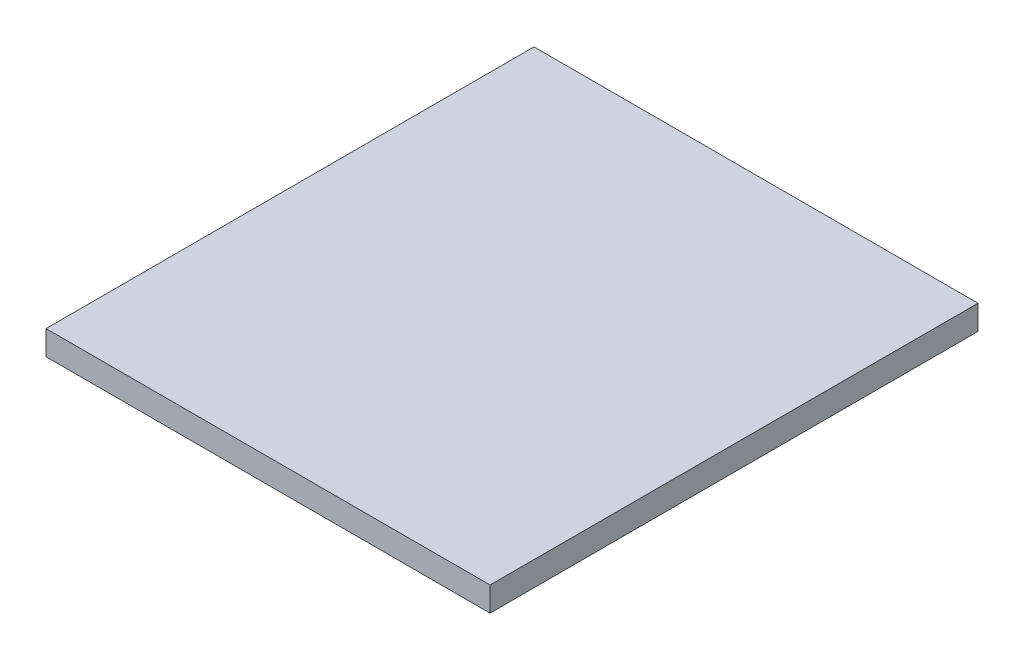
from build123d import *

# Parameters (mm, degrees)
SKETCH1_W      = 91
SKETCH1_H      = 5
EXTRUDE1_DEPTH = 100


with BuildPart() as part:
    # Sketch1 → Extrude1 (new body)
    with BuildSketch(Plane.XY):
        with Locations((0, 2.5)):
            Rectangle(SKETCH1_W, SKETCH1_H)
    extrude(amount=EXTRUDE1_DEPTH)


solid = part.part
